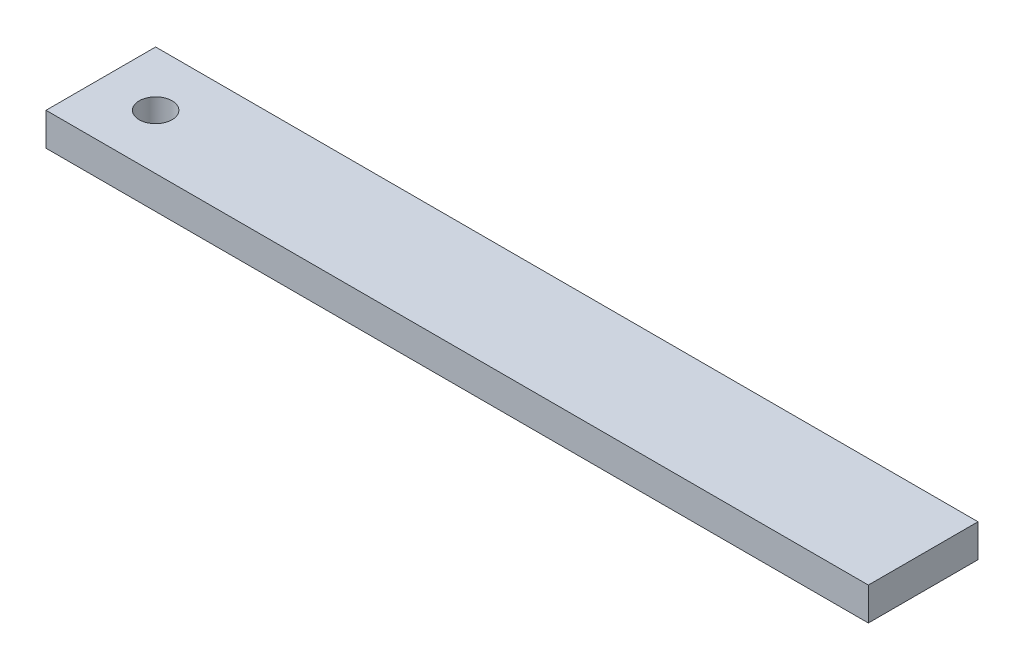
ISO-10303-21;
HEADER;
FILE_DESCRIPTION(('STEP AP214'),'2;1');
FILE_NAME('part.step','',(''),(''),'','','');
FILE_SCHEMA(('AUTOMOTIVE_DESIGN { 1 0 10303 214 1 1 1 1 }'));
ENDSEC;
DATA;
#1=APPLICATION_CONTEXT('core data for automotive mechanical design processes');
#2=APPLICATION_PROTOCOL_DEFINITION('international standard','automotive_design',2000,#1);
#3=PRODUCT_CONTEXT('',#1,'mechanical');
#4=PRODUCT('Part','Part','',(#3));
#5=PRODUCT_RELATED_PRODUCT_CATEGORY('part','',(#4));
#6=PRODUCT_DEFINITION_FORMATION('','',#4);
#7=PRODUCT_DEFINITION_CONTEXT('part definition',#1,'design');
#8=PRODUCT_DEFINITION('design','',#6,#7);
#9=PRODUCT_DEFINITION_SHAPE('','',#8);
#10=(LENGTH_UNIT() NAMED_UNIT(*) SI_UNIT(.MILLI.,.METRE.));
#11=(NAMED_UNIT(*) PLANE_ANGLE_UNIT() SI_UNIT($,.RADIAN.));
#12=(NAMED_UNIT(*) SI_UNIT($,.STERADIAN.) SOLID_ANGLE_UNIT());
#13=UNCERTAINTY_MEASURE_WITH_UNIT(LENGTH_MEASURE(1.E-05),#10,'distance_accuracy_value','');
#14=(GEOMETRIC_REPRESENTATION_CONTEXT(3) GLOBAL_UNCERTAINTY_ASSIGNED_CONTEXT((#13)) GLOBAL_UNIT_ASSIGNED_CONTEXT((#10,
#11,#12)) REPRESENTATION_CONTEXT('',''));
#15=CARTESIAN_POINT('',(0.,0.,0.));
#16=DIRECTION('',(0.,0.,1.));
#17=DIRECTION('',(1.,0.,0.));
#18=AXIS2_PLACEMENT_3D('',#15,#16,#17);
#19=CARTESIAN_POINT('',(0.,3.,0.));
#20=DIRECTION('',(0.,-1.,0.));
#21=DIRECTION('',(0.,0.,-1.));
#22=AXIS2_PLACEMENT_3D('',#19,#20,#21);
#23=PLANE('',#22);
#24=DIRECTION('',(0.,0.,1.));
#25=VECTOR('',#24,1.);
#26=CARTESIAN_POINT('',(-37.5,3.,-5.));
#27=LINE('',#26,#25);
#28=CARTESIAN_POINT('',(-37.5,3.,-5.));
#29=VERTEX_POINT('',#28);
#30=CARTESIAN_POINT('',(-37.5,3.,5.));
#31=VERTEX_POINT('',#30);
#32=EDGE_CURVE('E84',#29,#31,#27,.T.);
#33=ORIENTED_EDGE('',*,*,#32,.T.);
#34=DIRECTION('',(1.,0.,0.));
#35=VECTOR('',#34,1.);
#36=CARTESIAN_POINT('',(37.5,3.,4.99999999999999));
#37=LINE('',#36,#35);
#38=CARTESIAN_POINT('',(37.5,3.,4.99999999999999));
#39=VERTEX_POINT('',#38);
#40=EDGE_CURVE('E79',#31,#39,#37,.T.);
#41=ORIENTED_EDGE('',*,*,#40,.T.);
#42=DIRECTION('',(0.,0.,-1.));
#43=VECTOR('',#42,1.);
#44=CARTESIAN_POINT('',(37.5,3.,-5.));
#45=LINE('',#44,#43);
#46=CARTESIAN_POINT('',(37.5,3.,-5.));
#47=VERTEX_POINT('',#46);
#48=EDGE_CURVE('E82',#39,#47,#45,.T.);
#49=ORIENTED_EDGE('',*,*,#48,.T.);
#50=DIRECTION('',(-1.,0.,0.));
#51=VECTOR('',#50,1.);
#52=CARTESIAN_POINT('',(37.5,3.,-5.));
#53=LINE('',#52,#51);
#54=EDGE_CURVE('E49',#47,#29,#53,.T.);
#55=ORIENTED_EDGE('',*,*,#54,.T.);
#56=EDGE_LOOP('',(#33,#41,#49,#55));
#57=FACE_BOUND('',#56,.T.);
#58=CARTESIAN_POINT('',(-32.5,3.,0.));
#59=DIRECTION('',(0.,1.,0.));
#60=DIRECTION('',(0.,0.,1.));
#61=AXIS2_PLACEMENT_3D('',#58,#59,#60);
#62=CIRCLE('',#61,1.5);
#63=CARTESIAN_POINT('',(-32.5,3.,1.5));
#64=VERTEX_POINT('',#63);
#65=EDGE_CURVE('E99',#64,#64,#62,.T.);
#66=ORIENTED_EDGE('',*,*,#65,.F.);
#67=EDGE_LOOP('',(#66));
#68=FACE_BOUND('',#67,.T.);
#69=ADVANCED_FACE('F32',(#57,#68),#23,.F.);
#70=CARTESIAN_POINT('',(0.,0.,0.));
#71=DIRECTION('',(0.,-1.,0.));
#72=DIRECTION('',(0.,0.,-1.));
#73=AXIS2_PLACEMENT_3D('',#70,#71,#72);
#74=PLANE('',#73);
#75=DIRECTION('',(0.,0.,1.));
#76=VECTOR('',#75,1.);
#77=CARTESIAN_POINT('',(-37.5,0.,-5.));
#78=LINE('',#77,#76);
#79=CARTESIAN_POINT('',(-37.5,0.,-5.));
#80=VERTEX_POINT('',#79);
#81=CARTESIAN_POINT('',(-37.5,0.,5.));
#82=VERTEX_POINT('',#81);
#83=EDGE_CURVE('E96',#80,#82,#78,.T.);
#84=ORIENTED_EDGE('',*,*,#83,.F.);
#85=DIRECTION('',(-1.,0.,0.));
#86=VECTOR('',#85,1.);
#87=CARTESIAN_POINT('',(37.5,0.,-5.));
#88=LINE('',#87,#86);
#89=CARTESIAN_POINT('',(37.5,0.,-5.));
#90=VERTEX_POINT('',#89);
#91=EDGE_CURVE('E72',#90,#80,#88,.T.);
#92=ORIENTED_EDGE('',*,*,#91,.F.);
#93=DIRECTION('',(0.,0.,-1.));
#94=VECTOR('',#93,1.);
#95=CARTESIAN_POINT('',(37.5,0.,-5.));
#96=LINE('',#95,#94);
#97=CARTESIAN_POINT('',(37.5,0.,4.99999999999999));
#98=VERTEX_POINT('',#97);
#99=EDGE_CURVE('E66',#98,#90,#96,.T.);
#100=ORIENTED_EDGE('',*,*,#99,.F.);
#101=DIRECTION('',(1.,0.,0.));
#102=VECTOR('',#101,1.);
#103=CARTESIAN_POINT('',(37.5,0.,4.99999999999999));
#104=LINE('',#103,#102);
#105=EDGE_CURVE('E88',#82,#98,#104,.T.);
#106=ORIENTED_EDGE('',*,*,#105,.F.);
#107=EDGE_LOOP('',(#84,#92,#100,#106));
#108=FACE_BOUND('',#107,.T.);
#109=CARTESIAN_POINT('',(-32.5,0.,0.));
#110=DIRECTION('',(0.,1.,0.));
#111=DIRECTION('',(0.,0.,1.));
#112=AXIS2_PLACEMENT_3D('',#109,#110,#111);
#113=CIRCLE('',#112,1.5);
#114=CARTESIAN_POINT('',(-32.5,0.,1.5));
#115=VERTEX_POINT('',#114);
#116=EDGE_CURVE('E111',#115,#115,#113,.T.);
#117=ORIENTED_EDGE('',*,*,#116,.T.);
#118=EDGE_LOOP('',(#117));
#119=FACE_BOUND('',#118,.T.);
#120=ADVANCED_FACE('F107',(#108,#119),#74,.T.);
#121=CARTESIAN_POINT('',(-37.5,3.,-5.));
#122=DIRECTION('',(1.,0.,0.));
#123=DIRECTION('',(0.,0.,-1.));
#124=AXIS2_PLACEMENT_3D('',#121,#122,#123);
#125=PLANE('',#124);
#126=ORIENTED_EDGE('',*,*,#83,.T.);
#127=DIRECTION('',(0.,-1.,0.));
#128=VECTOR('',#127,1.);
#129=CARTESIAN_POINT('',(-37.5,3.,5.));
#130=LINE('',#129,#128);
#131=EDGE_CURVE('E11',#31,#82,#130,.T.);
#132=ORIENTED_EDGE('',*,*,#131,.F.);
#133=ORIENTED_EDGE('',*,*,#32,.F.);
#134=DIRECTION('',(0.,-1.,0.));
#135=VECTOR('',#134,1.);
#136=CARTESIAN_POINT('',(-37.5,3.,-5.));
#137=LINE('',#136,#135);
#138=EDGE_CURVE('E92',#29,#80,#137,.T.);
#139=ORIENTED_EDGE('',*,*,#138,.T.);
#140=EDGE_LOOP('',(#126,#132,#133,#139));
#141=FACE_BOUND('',#140,.T.);
#142=ADVANCED_FACE('F34',(#141),#125,.F.);
#143=CARTESIAN_POINT('',(37.5,3.,4.99999999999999));
#144=DIRECTION('',(0.,0.,-1.));
#145=DIRECTION('',(-1.,0.,0.));
#146=AXIS2_PLACEMENT_3D('',#143,#144,#145);
#147=PLANE('',#146);
#148=ORIENTED_EDGE('',*,*,#105,.T.);
#149=DIRECTION('',(0.,-1.,0.));
#150=VECTOR('',#149,1.);
#151=CARTESIAN_POINT('',(37.5,3.,4.99999999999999));
#152=LINE('',#151,#150);
#153=EDGE_CURVE('E41',#39,#98,#152,.T.);
#154=ORIENTED_EDGE('',*,*,#153,.F.);
#155=ORIENTED_EDGE('',*,*,#40,.F.);
#156=ORIENTED_EDGE('',*,*,#131,.T.);
#157=EDGE_LOOP('',(#148,#154,#155,#156));
#158=FACE_BOUND('',#157,.T.);
#159=ADVANCED_FACE('F87',(#158),#147,.F.);
#160=CARTESIAN_POINT('',(37.5,3.,-5.));
#161=DIRECTION('',(-1.,0.,0.));
#162=DIRECTION('',(0.,0.,1.));
#163=AXIS2_PLACEMENT_3D('',#160,#161,#162);
#164=PLANE('',#163);
#165=ORIENTED_EDGE('',*,*,#99,.T.);
#166=DIRECTION('',(0.,-1.,0.));
#167=VECTOR('',#166,1.);
#168=CARTESIAN_POINT('',(37.5,3.,-5.));
#169=LINE('',#168,#167);
#170=EDGE_CURVE('E89',#47,#90,#169,.T.);
#171=ORIENTED_EDGE('',*,*,#170,.F.);
#172=ORIENTED_EDGE('',*,*,#48,.F.);
#173=ORIENTED_EDGE('',*,*,#153,.T.);
#174=EDGE_LOOP('',(#165,#171,#172,#173));
#175=FACE_BOUND('',#174,.T.);
#176=ADVANCED_FACE('F90',(#175),#164,.F.);
#177=CARTESIAN_POINT('',(37.5,3.,-5.));
#178=DIRECTION('',(0.,0.,1.));
#179=DIRECTION('',(1.,0.,0.));
#180=AXIS2_PLACEMENT_3D('',#177,#178,#179);
#181=PLANE('',#180);
#182=ORIENTED_EDGE('',*,*,#91,.T.);
#183=ORIENTED_EDGE('',*,*,#138,.F.);
#184=ORIENTED_EDGE('',*,*,#54,.F.);
#185=ORIENTED_EDGE('',*,*,#170,.T.);
#186=EDGE_LOOP('',(#182,#183,#184,#185));
#187=FACE_BOUND('',#186,.T.);
#188=ADVANCED_FACE('F104',(#187),#181,.F.);
#189=CARTESIAN_POINT('',(-32.5,3.,0.));
#190=DIRECTION('',(0.,-1.,0.));
#191=DIRECTION('',(0.,0.,-1.));
#192=AXIS2_PLACEMENT_3D('',#189,#190,#191);
#193=CYLINDRICAL_SURFACE('',#192,1.5);
#194=ORIENTED_EDGE('',*,*,#65,.T.);
#195=EDGE_LOOP('',(#194));
#196=FACE_BOUND('',#195,.T.);
#197=ORIENTED_EDGE('',*,*,#116,.F.);
#198=EDGE_LOOP('',(#197));
#199=FACE_BOUND('',#198,.T.);
#200=ADVANCED_FACE('F117',(#196,#199),#193,.F.);
#201=CLOSED_SHELL('',(#69,#120,#142,#159,#176,#188,#200));
#202=MANIFOLD_SOLID_BREP('B2',#201);
#203=ADVANCED_BREP_SHAPE_REPRESENTATION('',(#18,#202),#14);
#204=SHAPE_DEFINITION_REPRESENTATION(#9,#203);
ENDSEC;
END-ISO-10303-21;
